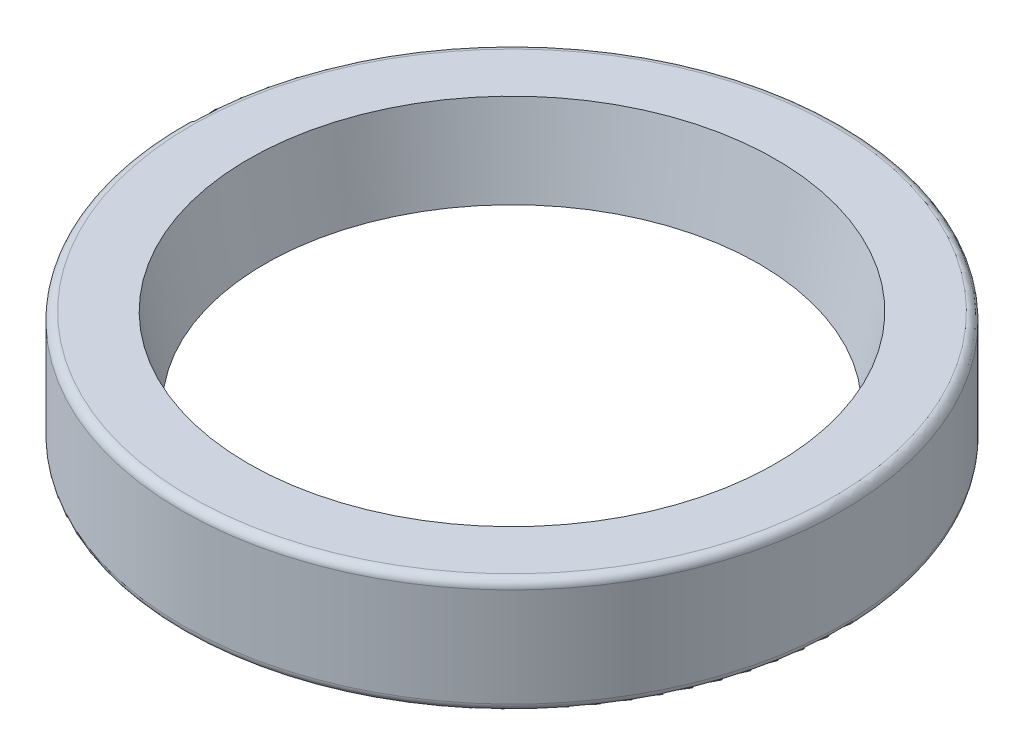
ISO-10303-21;
HEADER;
FILE_DESCRIPTION(('STEP AP214'),'2;1');
FILE_NAME('part.step','',(''),(''),'','','');
FILE_SCHEMA(('AUTOMOTIVE_DESIGN { 1 0 10303 214 1 1 1 1 }'));
ENDSEC;
DATA;
#1=APPLICATION_CONTEXT('core data for automotive mechanical design processes');
#2=APPLICATION_PROTOCOL_DEFINITION('international standard','automotive_design',2000,#1);
#3=PRODUCT_CONTEXT('',#1,'mechanical');
#4=PRODUCT('Part','Part','',(#3));
#5=PRODUCT_RELATED_PRODUCT_CATEGORY('part','',(#4));
#6=PRODUCT_DEFINITION_FORMATION('','',#4);
#7=PRODUCT_DEFINITION_CONTEXT('part definition',#1,'design');
#8=PRODUCT_DEFINITION('design','',#6,#7);
#9=PRODUCT_DEFINITION_SHAPE('','',#8);
#10=(LENGTH_UNIT() NAMED_UNIT(*) SI_UNIT(.MILLI.,.METRE.));
#11=(NAMED_UNIT(*) PLANE_ANGLE_UNIT() SI_UNIT($,.RADIAN.));
#12=(NAMED_UNIT(*) SI_UNIT($,.STERADIAN.) SOLID_ANGLE_UNIT());
#13=UNCERTAINTY_MEASURE_WITH_UNIT(LENGTH_MEASURE(1.E-05),#10,'distance_accuracy_value','');
#14=(GEOMETRIC_REPRESENTATION_CONTEXT(3) GLOBAL_UNCERTAINTY_ASSIGNED_CONTEXT((#13)) GLOBAL_UNIT_ASSIGNED_CONTEXT((#10,
#11,#12)) REPRESENTATION_CONTEXT('',''));
#15=CARTESIAN_POINT('',(0.,0.,0.));
#16=DIRECTION('',(0.,0.,1.));
#17=DIRECTION('',(1.,0.,0.));
#18=AXIS2_PLACEMENT_3D('',#15,#16,#17);
#19=CARTESIAN_POINT('',(0.,17.8503764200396,0.));
#20=DIRECTION('',(0.,1.,0.));
#21=DIRECTION('',(0.,0.,1.));
#22=AXIS2_PLACEMENT_3D('',#19,#20,#21);
#23=CYLINDRICAL_SURFACE('',#22,20.);
#24=CARTESIAN_POINT('',(0.,0.5,0.));
#25=DIRECTION('',(0.,1.,0.));
#26=DIRECTION('',(0.,0.,1.));
#27=AXIS2_PLACEMENT_3D('',#24,#25,#26);
#28=CIRCLE('',#27,20.);
#29=CARTESIAN_POINT('',(0.,0.5,20.));
#30=VERTEX_POINT('',#29);
#31=EDGE_CURVE('E43',#30,#30,#28,.T.);
#32=ORIENTED_EDGE('',*,*,#31,.T.);
#33=EDGE_LOOP('',(#32));
#34=FACE_BOUND('',#33,.T.);
#35=CARTESIAN_POINT('',(0.,6.50000000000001,0.));
#36=DIRECTION('',(0.,-1.,0.));
#37=DIRECTION('',(0.,0.,-1.));
#38=AXIS2_PLACEMENT_3D('',#35,#36,#37);
#39=CIRCLE('',#38,20.);
#40=CARTESIAN_POINT('',(0.,6.50000000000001,-20.));
#41=VERTEX_POINT('',#40);
#42=EDGE_CURVE('E47',#41,#41,#39,.T.);
#43=ORIENTED_EDGE('',*,*,#42,.T.);
#44=EDGE_LOOP('',(#43));
#45=FACE_BOUND('',#44,.T.);
#46=ADVANCED_FACE('F32',(#34,#45),#23,.T.);
#47=CARTESIAN_POINT('',(16.,7.00000000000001,0.));
#48=DIRECTION('',(0.,-1.,0.));
#49=DIRECTION('',(0.,0.,-1.));
#50=AXIS2_PLACEMENT_3D('',#47,#48,#49);
#51=PLANE('',#50);
#52=CARTESIAN_POINT('',(0.,7.00000000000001,0.));
#53=DIRECTION('',(0.,-1.,0.));
#54=DIRECTION('',(0.,0.,-1.));
#55=AXIS2_PLACEMENT_3D('',#52,#53,#54);
#56=CIRCLE('',#55,19.5);
#57=CARTESIAN_POINT('',(0.,7.00000000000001,-19.5));
#58=VERTEX_POINT('',#57);
#59=EDGE_CURVE('E10',#58,#58,#56,.F.);
#60=ORIENTED_EDGE('',*,*,#59,.T.);
#61=EDGE_LOOP('',(#60));
#62=FACE_BOUND('',#61,.T.);
#63=CARTESIAN_POINT('',(0.,7.00000000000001,0.));
#64=DIRECTION('',(0.,1.,0.));
#65=DIRECTION('',(0.,0.,1.));
#66=AXIS2_PLACEMENT_3D('',#63,#64,#65);
#67=CIRCLE('',#66,16.);
#68=CARTESIAN_POINT('',(0.,7.00000000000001,16.));
#69=VERTEX_POINT('',#68);
#70=EDGE_CURVE('E52',#69,#69,#67,.T.);
#71=ORIENTED_EDGE('',*,*,#70,.F.);
#72=EDGE_LOOP('',(#71));
#73=FACE_BOUND('',#72,.T.);
#74=ADVANCED_FACE('F109',(#62,#73),#51,.F.);
#75=CARTESIAN_POINT('',(0.,7.00000000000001,0.));
#76=DIRECTION('',(0.,1.,0.));
#77=DIRECTION('',(0.,0.,1.));
#78=AXIS2_PLACEMENT_3D('',#75,#76,#77);
#79=CONICAL_SURFACE('',#78,16.,0.197395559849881);
#80=CARTESIAN_POINT('',(0.,2.,0.));
#81=DIRECTION('',(0.,1.,0.));
#82=DIRECTION('',(0.,0.,1.));
#83=AXIS2_PLACEMENT_3D('',#80,#81,#82);
#84=CIRCLE('',#83,15.);
#85=CARTESIAN_POINT('',(0.,2.,15.));
#86=VERTEX_POINT('',#85);
#87=EDGE_CURVE('E55',#86,#86,#84,.T.);
#88=ORIENTED_EDGE('',*,*,#87,.F.);
#89=EDGE_LOOP('',(#88));
#90=FACE_BOUND('',#89,.T.);
#91=ORIENTED_EDGE('',*,*,#70,.T.);
#92=EDGE_LOOP('',(#91));
#93=FACE_BOUND('',#92,.T.);
#94=ADVANCED_FACE('F103',(#90,#93),#79,.F.);
#95=CARTESIAN_POINT('',(0.,2.,0.));
#96=DIRECTION('',(0.,-1.,0.));
#97=DIRECTION('',(0.,0.,-1.));
#98=AXIS2_PLACEMENT_3D('',#95,#96,#97);
#99=CONICAL_SURFACE('',#98,15.,1.02433491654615);
#100=CARTESIAN_POINT('',(0.,1.,0.));
#101=DIRECTION('',(0.,1.,0.));
#102=DIRECTION('',(0.,0.,1.));
#103=AXIS2_PLACEMENT_3D('',#100,#101,#102);
#104=CIRCLE('',#103,16.644068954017);
#105=CARTESIAN_POINT('',(0.,1.,16.644068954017));
#106=VERTEX_POINT('',#105);
#107=EDGE_CURVE('E58',#106,#106,#104,.T.);
#108=ORIENTED_EDGE('',*,*,#107,.F.);
#109=EDGE_LOOP('',(#108));
#110=FACE_BOUND('',#109,.T.);
#111=ORIENTED_EDGE('',*,*,#87,.T.);
#112=EDGE_LOOP('',(#111));
#113=FACE_BOUND('',#112,.T.);
#114=ADVANCED_FACE('F97',(#110,#113),#99,.F.);
#115=CARTESIAN_POINT('',(16.644068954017,1.,0.));
#116=DIRECTION('',(0.,1.,0.));
#117=DIRECTION('',(0.,0.,1.));
#118=AXIS2_PLACEMENT_3D('',#115,#116,#117);
#119=PLANE('',#118);
#120=CARTESIAN_POINT('',(0.,1.,0.));
#121=DIRECTION('',(0.,1.,0.));
#122=DIRECTION('',(0.,0.,1.));
#123=AXIS2_PLACEMENT_3D('',#120,#121,#122);
#124=CIRCLE('',#123,17.5);
#125=CARTESIAN_POINT('',(0.,1.,17.5));
#126=VERTEX_POINT('',#125);
#127=EDGE_CURVE('E61',#126,#126,#124,.T.);
#128=ORIENTED_EDGE('',*,*,#127,.F.);
#129=EDGE_LOOP('',(#128));
#130=FACE_BOUND('',#129,.T.);
#131=ORIENTED_EDGE('',*,*,#107,.T.);
#132=EDGE_LOOP('',(#131));
#133=FACE_BOUND('',#132,.T.);
#134=ADVANCED_FACE('F91',(#130,#133),#119,.F.);
#135=CARTESIAN_POINT('',(0.,17.8503764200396,0.));
#136=DIRECTION('',(0.,1.,0.));
#137=DIRECTION('',(0.,0.,1.));
#138=AXIS2_PLACEMENT_3D('',#135,#136,#137);
#139=CYLINDRICAL_SURFACE('',#138,17.5);
#140=CARTESIAN_POINT('',(0.,5.50000000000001,0.));
#141=DIRECTION('',(0.,1.,0.));
#142=DIRECTION('',(0.,0.,1.));
#143=AXIS2_PLACEMENT_3D('',#140,#141,#142);
#144=CIRCLE('',#143,17.5);
#145=CARTESIAN_POINT('',(0.,5.50000000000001,17.5));
#146=VERTEX_POINT('',#145);
#147=EDGE_CURVE('E64',#146,#146,#144,.T.);
#148=ORIENTED_EDGE('',*,*,#147,.F.);
#149=EDGE_LOOP('',(#148));
#150=FACE_BOUND('',#149,.T.);
#151=ORIENTED_EDGE('',*,*,#127,.T.);
#152=EDGE_LOOP('',(#151));
#153=FACE_BOUND('',#152,.T.);
#154=ADVANCED_FACE('F85',(#150,#153),#139,.T.);
#155=CARTESIAN_POINT('',(17.5,5.50000000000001,0.));
#156=DIRECTION('',(0.,1.,0.));
#157=DIRECTION('',(0.,0.,1.));
#158=AXIS2_PLACEMENT_3D('',#155,#156,#157);
#159=PLANE('',#158);
#160=CARTESIAN_POINT('',(0.,5.50000000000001,0.));
#161=DIRECTION('',(0.,1.,0.));
#162=DIRECTION('',(0.,0.,1.));
#163=AXIS2_PLACEMENT_3D('',#160,#161,#162);
#164=CIRCLE('',#163,18.5);
#165=CARTESIAN_POINT('',(0.,5.50000000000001,18.5));
#166=VERTEX_POINT('',#165);
#167=EDGE_CURVE('E67',#166,#166,#164,.T.);
#168=ORIENTED_EDGE('',*,*,#167,.F.);
#169=EDGE_LOOP('',(#168));
#170=FACE_BOUND('',#169,.T.);
#171=ORIENTED_EDGE('',*,*,#147,.T.);
#172=EDGE_LOOP('',(#171));
#173=FACE_BOUND('',#172,.T.);
#174=ADVANCED_FACE('F79',(#170,#173),#159,.F.);
#175=CARTESIAN_POINT('',(0.,17.8503764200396,0.));
#176=DIRECTION('',(0.,1.,0.));
#177=DIRECTION('',(0.,0.,1.));
#178=AXIS2_PLACEMENT_3D('',#175,#176,#177);
#179=CYLINDRICAL_SURFACE('',#178,18.5);
#180=CARTESIAN_POINT('',(0.,0.,0.));
#181=DIRECTION('',(0.,1.,0.));
#182=DIRECTION('',(0.,0.,1.));
#183=AXIS2_PLACEMENT_3D('',#180,#181,#182);
#184=CIRCLE('',#183,18.5);
#185=CARTESIAN_POINT('',(0.,0.,18.5));
#186=VERTEX_POINT('',#185);
#187=EDGE_CURVE('E70',#186,#186,#184,.T.);
#188=ORIENTED_EDGE('',*,*,#187,.F.);
#189=EDGE_LOOP('',(#188));
#190=FACE_BOUND('',#189,.T.);
#191=ORIENTED_EDGE('',*,*,#167,.T.);
#192=EDGE_LOOP('',(#191));
#193=FACE_BOUND('',#192,.T.);
#194=ADVANCED_FACE('F76',(#190,#193),#179,.F.);
#195=CARTESIAN_POINT('',(18.5,0.,0.));
#196=DIRECTION('',(0.,1.,0.));
#197=DIRECTION('',(0.,0.,1.));
#198=AXIS2_PLACEMENT_3D('',#195,#196,#197);
#199=PLANE('',#198);
#200=CARTESIAN_POINT('',(0.,0.,0.));
#201=DIRECTION('',(0.,1.,0.));
#202=DIRECTION('',(0.,0.,1.));
#203=AXIS2_PLACEMENT_3D('',#200,#201,#202);
#204=CIRCLE('',#203,19.5);
#205=CARTESIAN_POINT('',(0.,0.,19.5));
#206=VERTEX_POINT('',#205);
#207=EDGE_CURVE('E39',#206,#206,#204,.F.);
#208=ORIENTED_EDGE('',*,*,#207,.T.);
#209=EDGE_LOOP('',(#208));
#210=FACE_BOUND('',#209,.T.);
#211=ORIENTED_EDGE('',*,*,#187,.T.);
#212=EDGE_LOOP('',(#211));
#213=FACE_BOUND('',#212,.T.);
#214=ADVANCED_FACE('F74',(#210,#213),#199,.F.);
#215=CARTESIAN_POINT('',(0.,0.5,0.));
#216=DIRECTION('',(0.,1.,0.));
#217=DIRECTION('',(0.,0.,1.));
#218=AXIS2_PLACEMENT_3D('',#215,#216,#217);
#219=TOROIDAL_SURFACE('',#218,19.5,0.5);
#220=ORIENTED_EDGE('',*,*,#207,.F.);
#221=EDGE_LOOP('',(#220));
#222=FACE_BOUND('',#221,.T.);
#223=ORIENTED_EDGE('',*,*,#31,.F.);
#224=EDGE_LOOP('',(#223));
#225=FACE_BOUND('',#224,.T.);
#226=ADVANCED_FACE('F120',(#222,#225),#219,.T.);
#227=CARTESIAN_POINT('',(0.,6.50000000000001,0.));
#228=DIRECTION('',(0.,-1.,0.));
#229=DIRECTION('',(0.,0.,-1.));
#230=AXIS2_PLACEMENT_3D('',#227,#228,#229);
#231=TOROIDAL_SURFACE('',#230,19.5,0.5);
#232=ORIENTED_EDGE('',*,*,#42,.F.);
#233=EDGE_LOOP('',(#232));
#234=FACE_BOUND('',#233,.T.);
#235=ORIENTED_EDGE('',*,*,#59,.F.);
#236=EDGE_LOOP('',(#235));
#237=FACE_BOUND('',#236,.T.);
#238=ADVANCED_FACE('F34',(#234,#237),#231,.T.);
#239=CLOSED_SHELL('',(#46,#74,#94,#114,#134,#154,#174,#194,#214,#226,#238));
#240=MANIFOLD_SOLID_BREP('B2',#239);
#241=ADVANCED_BREP_SHAPE_REPRESENTATION('',(#18,#240),#14);
#242=SHAPE_DEFINITION_REPRESENTATION(#9,#241);
ENDSEC;
END-ISO-10303-21;
